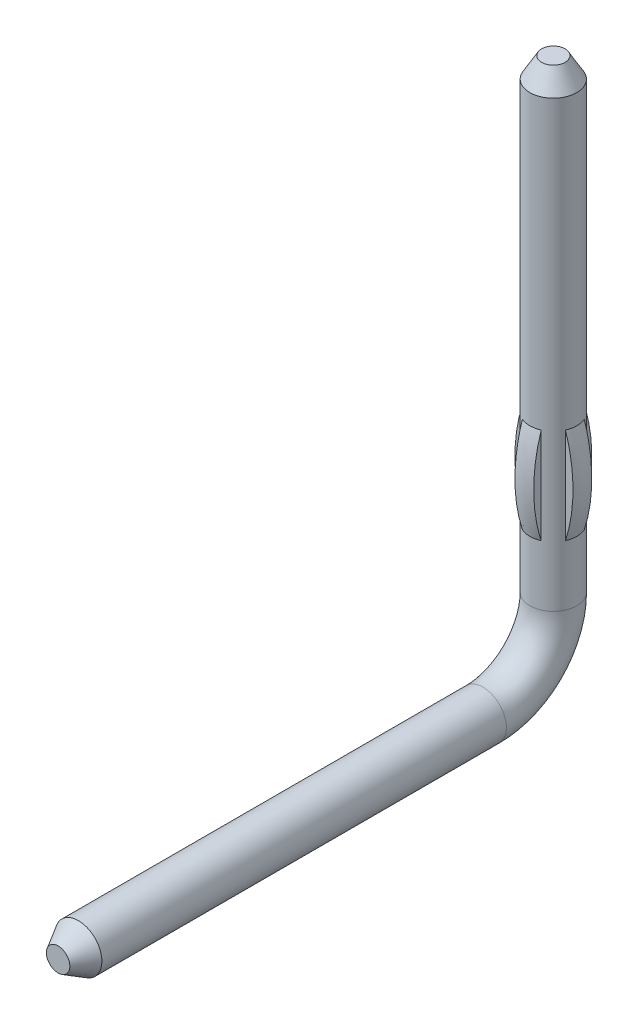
ISO-10303-21;
HEADER;
FILE_DESCRIPTION(('STEP AP214'),'2;1');
FILE_NAME('part.step','',(''),(''),'','','');
FILE_SCHEMA(('AUTOMOTIVE_DESIGN { 1 0 10303 214 1 1 1 1 }'));
ENDSEC;
DATA;
#1=APPLICATION_CONTEXT('core data for automotive mechanical design processes');
#2=APPLICATION_PROTOCOL_DEFINITION('international standard','automotive_design',2000,#1);
#3=PRODUCT_CONTEXT('',#1,'mechanical');
#4=PRODUCT('Part','Part','',(#3));
#5=PRODUCT_RELATED_PRODUCT_CATEGORY('part','',(#4));
#6=PRODUCT_DEFINITION_FORMATION('','',#4);
#7=PRODUCT_DEFINITION_CONTEXT('part definition',#1,'design');
#8=PRODUCT_DEFINITION('design','',#6,#7);
#9=PRODUCT_DEFINITION_SHAPE('','',#8);
#10=(LENGTH_UNIT() NAMED_UNIT(*) SI_UNIT(.MILLI.,.METRE.));
#11=(NAMED_UNIT(*) PLANE_ANGLE_UNIT() SI_UNIT($,.RADIAN.));
#12=(NAMED_UNIT(*) SI_UNIT($,.STERADIAN.) SOLID_ANGLE_UNIT());
#13=UNCERTAINTY_MEASURE_WITH_UNIT(LENGTH_MEASURE(1.E-05),#10,'distance_accuracy_value','');
#14=(GEOMETRIC_REPRESENTATION_CONTEXT(3) GLOBAL_UNCERTAINTY_ASSIGNED_CONTEXT((#13)) GLOBAL_UNIT_ASSIGNED_CONTEXT((#10,
#11,#12)) REPRESENTATION_CONTEXT('',''));
#15=CARTESIAN_POINT('',(0.,0.,0.));
#16=DIRECTION('',(0.,0.,1.));
#17=DIRECTION('',(1.,0.,0.));
#18=AXIS2_PLACEMENT_3D('',#15,#16,#17);
#19=CARTESIAN_POINT('',(-2.135349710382,-0.6651640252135,5.275));
#20=DIRECTION('',(0.,0.,1.));
#21=DIRECTION('',(0.,-1.,0.));
#22=AXIS2_PLACEMENT_3D('',#19,#20,#21);
#23=PLANE('',#22);
#24=CARTESIAN_POINT('',(-2.,-0.8,5.27499999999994));
#25=DIRECTION('',(0.,0.,-1.));
#26=DIRECTION('',(-1.,0.,0.));
#27=AXIS2_PLACEMENT_3D('',#24,#25,#26);
#28=CIRCLE('',#27,0.125000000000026);
#29=CARTESIAN_POINT('',(-2.12500000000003,-0.8,5.27499999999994));
#30=VERTEX_POINT('',#29);
#31=EDGE_CURVE('E21',#30,#30,#28,.F.);
#32=ORIENTED_EDGE('',*,*,#31,.T.);
#33=EDGE_LOOP('',(#32));
#34=FACE_BOUND('',#33,.T.);
#35=ADVANCED_FACE('F17',(#34),#23,.T.);
#36=CARTESIAN_POINT('',(-2.,-0.8,5.05849364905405));
#37=DIRECTION('',(0.,0.,-1.));
#38=DIRECTION('',(-1.,0.,0.));
#39=AXIS2_PLACEMENT_3D('',#36,#37,#38);
#40=CONICAL_SURFACE('',#39,0.249999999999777,0.523598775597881);
#41=CARTESIAN_POINT('',(-2.,-0.8,5.05849364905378));
#42=DIRECTION('',(0.,0.,1.));
#43=DIRECTION('',(0.,-1.,0.));
#44=AXIS2_PLACEMENT_3D('',#41,#42,#43);
#45=CIRCLE('',#44,0.25);
#46=CARTESIAN_POINT('',(-2.,-1.05,5.05849364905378));
#47=VERTEX_POINT('',#46);
#48=EDGE_CURVE('E88',#47,#47,#45,.T.);
#49=ORIENTED_EDGE('',*,*,#48,.T.);
#50=EDGE_LOOP('',(#49));
#51=FACE_BOUND('',#50,.T.);
#52=ORIENTED_EDGE('',*,*,#31,.F.);
#53=EDGE_LOOP('',(#52));
#54=FACE_BOUND('',#53,.T.);
#55=ADVANCED_FACE('F173',(#51,#54),#40,.T.);
#56=CARTESIAN_POINT('',(-2.,-0.8,0.749999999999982));
#57=DIRECTION('',(0.,0.,1.));
#58=DIRECTION('',(1.,0.,0.));
#59=AXIS2_PLACEMENT_3D('',#56,#57,#58);
#60=CYLINDRICAL_SURFACE('',#59,0.25);
#61=ORIENTED_EDGE('',*,*,#48,.F.);
#62=EDGE_LOOP('',(#61));
#63=FACE_BOUND('',#62,.T.);
#64=CARTESIAN_POINT('',(-2.,-0.8,0.749999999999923));
#65=DIRECTION('',(0.,1.03212393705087E-13,-1.));
#66=DIRECTION('',(0.0627905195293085,-0.998026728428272,-1.03008727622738E-13));
#67=AXIS2_PLACEMENT_3D('',#64,#65,#66);
#68=CIRCLE('',#67,0.25);
#69=CARTESIAN_POINT('',(-1.98430237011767,-1.04950668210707,0.749999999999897));
#70=VERTEX_POINT('',#69);
#71=EDGE_CURVE('E160',#70,#70,#68,.F.);
#72=ORIENTED_EDGE('',*,*,#71,.T.);
#73=EDGE_LOOP('',(#72));
#74=FACE_BOUND('',#73,.T.);
#75=ADVANCED_FACE('F118',(#63,#74),#60,.T.);
#76=CARTESIAN_POINT('',(-1.9,0.5696,0.3190688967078));
#77=DIRECTION('',(1.,0.,0.));
#78=DIRECTION('',(0.,0.,-1.));
#79=AXIS2_PLACEMENT_3D('',#76,#77,#78);
#80=PLANE('',#79);
#81=CARTESIAN_POINT('',(-1.9,1.61000000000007,0.22912878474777));
#82=CARTESIAN_POINT('',(-1.9,1.57873023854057,0.239375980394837));
#83=CARTESIAN_POINT('',(-1.9,1.54713852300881,0.248610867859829));
#84=CARTESIAN_POINT('',(-1.9,1.48345199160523,0.265095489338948));
#85=CARTESIAN_POINT('',(-1.9,1.45135734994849,0.272345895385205));
#86=CARTESIAN_POINT('',(-1.9,1.35425691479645,0.291235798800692));
#87=CARTESIAN_POINT('',(-1.9,1.28866987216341,0.299938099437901));
#88=CARTESIAN_POINT('',(-1.9,1.12854165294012,0.31163857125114));
#89=CARTESIAN_POINT('',(-1.9,1.03366604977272,0.310580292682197));
#90=CARTESIAN_POINT('',(-1.9,0.89273024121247,0.297089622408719));
#91=CARTESIAN_POINT('',(-1.9,0.846013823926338,0.290617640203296));
#92=CARTESIAN_POINT('',(-1.9,0.753312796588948,0.273699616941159));
#93=CARTESIAN_POINT('',(-1.9,0.707327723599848,0.263256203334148));
#94=CARTESIAN_POINT('',(-1.9,0.637769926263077,0.244137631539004));
#95=CARTESIAN_POINT('',(-1.9,0.613787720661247,0.236925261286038));
#96=CARTESIAN_POINT('',(-1.9,0.589999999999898,0.229128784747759));
#97=B_SPLINE_CURVE_WITH_KNOTS('',3,(#81,#82,#83,#84,#85,#86,#87,#88,#89,#90,#91,#92,#93,#94,#95,
#96),.UNSPECIFIED.,.F.,.F.,(4,2,2,2,2,2,2,4),(0.,0.0986850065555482,0.197336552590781,
0.395376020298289,0.678491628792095,0.819849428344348,0.961113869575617,1.03621412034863),.UNSPECIFIED.);
#98=CARTESIAN_POINT('',(-1.89999999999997,1.61000000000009,0.229128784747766));
#99=VERTEX_POINT('',#98);
#100=CARTESIAN_POINT('',(-1.89999999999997,0.589999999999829,0.22912878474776));
#101=VERTEX_POINT('',#100);
#102=EDGE_CURVE('E154',#99,#101,#97,.T.);
#103=ORIENTED_EDGE('',*,*,#102,.T.);
#104=DIRECTION('',(0.,1.,0.));
#105=VECTOR('',#104,1.);
#106=CARTESIAN_POINT('',(-1.89999999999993,2.31674682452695,0.229128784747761));
#107=LINE('',#106,#105);
#108=EDGE_CURVE('E101',#101,#99,#107,.T.);
#109=ORIENTED_EDGE('',*,*,#108,.T.);
#110=EDGE_LOOP('',(#103,#109));
#111=FACE_BOUND('',#110,.T.);
#112=ADVANCED_FACE('F167',(#111),#80,.T.);
#113=CARTESIAN_POINT('',(-1.9,0.5696,-0.3190688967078));
#114=DIRECTION('',(-1.,0.,0.));
#115=DIRECTION('',(0.,0.,1.));
#116=AXIS2_PLACEMENT_3D('',#113,#114,#115);
#117=PLANE('',#116);
#118=CARTESIAN_POINT('',(-1.9,0.5899999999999,-0.229128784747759));
#119=CARTESIAN_POINT('',(-1.9,0.621269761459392,-0.239375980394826));
#120=CARTESIAN_POINT('',(-1.9,0.652861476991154,-0.248610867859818));
#121=CARTESIAN_POINT('',(-1.9,0.716548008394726,-0.265095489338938));
#122=CARTESIAN_POINT('',(-1.9,0.748642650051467,-0.272345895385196));
#123=CARTESIAN_POINT('',(-1.9,0.845743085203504,-0.291235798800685));
#124=CARTESIAN_POINT('',(-1.9,0.911330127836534,-0.299938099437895));
#125=CARTESIAN_POINT('',(-1.9,1.07145834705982,-0.311638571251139));
#126=CARTESIAN_POINT('',(-1.9,1.16633395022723,-0.3105802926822));
#127=CARTESIAN_POINT('',(-1.9,1.30726975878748,-0.297089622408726));
#128=CARTESIAN_POINT('',(-1.9,1.35398617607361,-0.290617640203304));
#129=CARTESIAN_POINT('',(-1.9,1.446687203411,-0.27369961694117));
#130=CARTESIAN_POINT('',(-1.9,1.4926722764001,-0.263256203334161));
#131=CARTESIAN_POINT('',(-1.9,1.56223007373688,-0.244137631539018));
#132=CARTESIAN_POINT('',(-1.9,1.58621227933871,-0.236925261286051));
#133=CARTESIAN_POINT('',(-1.9,1.61000000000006,-0.229128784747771));
#134=B_SPLINE_CURVE_WITH_KNOTS('',3,(#118,#119,#120,#121,#122,#123,#124,#125,#126,#127,#128,
#129,#130,#131,#132,#133),.UNSPECIFIED.,.F.,.F.,(4,2,2,2,2,2,2,4),(0.,0.0986850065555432,
0.197336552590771,0.39537602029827,0.678491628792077,0.81984942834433,0.961113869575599,
1.03621412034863),.UNSPECIFIED.);
#135=CARTESIAN_POINT('',(-1.9,0.58999999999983,-0.229128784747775));
#136=VERTEX_POINT('',#135);
#137=CARTESIAN_POINT('',(-1.9,1.61000000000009,-0.229128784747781));
#138=VERTEX_POINT('',#137);
#139=EDGE_CURVE('E278',#136,#138,#134,.T.);
#140=ORIENTED_EDGE('',*,*,#139,.T.);
#141=DIRECTION('',(0.,-1.,0.));
#142=VECTOR('',#141,1.);
#143=CARTESIAN_POINT('',(-1.9,2.31674682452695,-0.229128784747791));
#144=LINE('',#143,#142);
#145=EDGE_CURVE('E98',#138,#136,#144,.T.);
#146=ORIENTED_EDGE('',*,*,#145,.T.);
#147=EDGE_LOOP('',(#140,#146));
#148=FACE_BOUND('',#147,.T.);
#149=ADVANCED_FACE('F134',(#148),#117,.F.);
#150=CARTESIAN_POINT('',(-1.780707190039,0.5696,0.1));
#151=DIRECTION('',(0.,0.,1.));
#152=DIRECTION('',(1.,0.,0.));
#153=AXIS2_PLACEMENT_3D('',#150,#151,#152);
#154=PLANE('',#153);
#155=CARTESIAN_POINT('',(-1.77087121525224,0.589999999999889,0.1));
#156=CARTESIAN_POINT('',(-1.76062401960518,0.621269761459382,0.1));
#157=CARTESIAN_POINT('',(-1.75138913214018,0.652861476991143,0.1));
#158=CARTESIAN_POINT('',(-1.73490451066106,0.716548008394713,0.1));
#159=CARTESIAN_POINT('',(-1.72765410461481,0.748642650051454,0.1));
#160=CARTESIAN_POINT('',(-1.70876420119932,0.845743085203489,0.0999999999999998));
#161=CARTESIAN_POINT('',(-1.70006190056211,0.911330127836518,0.0999999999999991));
#162=CARTESIAN_POINT('',(-1.68836142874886,1.0714583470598,0.0999999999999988));
#163=CARTESIAN_POINT('',(-1.6894197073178,1.16633395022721,0.0999999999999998));
#164=CARTESIAN_POINT('',(-1.70291037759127,1.30726975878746,0.1));
#165=CARTESIAN_POINT('',(-1.70938235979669,1.35398617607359,0.1));
#166=CARTESIAN_POINT('',(-1.72630038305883,1.44668720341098,0.1));
#167=CARTESIAN_POINT('',(-1.73674379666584,1.49267227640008,0.1));
#168=CARTESIAN_POINT('',(-1.75586236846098,1.56223007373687,0.1));
#169=CARTESIAN_POINT('',(-1.76307473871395,1.58621227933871,0.1));
#170=CARTESIAN_POINT('',(-1.77087121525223,1.61000000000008,0.1));
#171=B_SPLINE_CURVE_WITH_KNOTS('',3,(#155,#156,#157,#158,#159,#160,#161,#162,#163,#164,#165,
#166,#167,#168,#169,#170),.UNSPECIFIED.,.F.,.F.,(4,2,2,2,2,2,2,4),(0.,0.0986850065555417,
0.197336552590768,0.395376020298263,0.67849162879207,0.819849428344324,0.961113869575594,
1.03621412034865),.UNSPECIFIED.);
#172=CARTESIAN_POINT('',(-1.77087121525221,0.589999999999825,0.099999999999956));
#173=VERTEX_POINT('',#172);
#174=CARTESIAN_POINT('',(-1.7708712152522,1.61000000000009,0.0999999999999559));
#175=VERTEX_POINT('',#174);
#176=EDGE_CURVE('E80',#173,#175,#171,.T.);
#177=ORIENTED_EDGE('',*,*,#176,.T.);
#178=DIRECTION('',(0.,-1.,0.));
#179=VECTOR('',#178,1.);
#180=CARTESIAN_POINT('',(-1.77087121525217,2.31674682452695,0.0999999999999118));
#181=LINE('',#180,#179);
#182=EDGE_CURVE('E86',#175,#173,#181,.T.);
#183=ORIENTED_EDGE('',*,*,#182,.T.);
#184=EDGE_LOOP('',(#177,#183));
#185=FACE_BOUND('',#184,.T.);
#186=ADVANCED_FACE('F85',(#185),#154,.T.);
#187=CARTESIAN_POINT('',(-2.,1.1,-1.4465));
#188=DIRECTION('',(1.,0.,0.));
#189=DIRECTION('',(0.,0.299058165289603,0.95423488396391));
#190=AXIS2_PLACEMENT_3D('',#187,#188,#189);
#191=CIRCLE('',#190,1.7715);
#192=TRIMMED_CURVE('',#191,(PARAMETER_VALUE(-0.31169960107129)),
(PARAMETER_VALUE(0.919110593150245)),.T.,.PARAMETER.);
#193=CARTESIAN_POINT('',(-2.,1.1,0.));
#194=DIRECTION('',(0.,-1.,0.));
#195=AXIS1_PLACEMENT('',#193,#194);
#196=SURFACE_OF_REVOLUTION('',#192,#195);
#197=CARTESIAN_POINT('',(-1.77087121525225,0.589999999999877,-0.1));
#198=CARTESIAN_POINT('',(-1.76062401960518,0.621269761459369,-0.1));
#199=CARTESIAN_POINT('',(-1.75138913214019,0.652861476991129,-0.1));
#200=CARTESIAN_POINT('',(-1.73490451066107,0.716548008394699,-0.1));
#201=CARTESIAN_POINT('',(-1.72765410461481,0.748642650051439,-0.1));
#202=CARTESIAN_POINT('',(-1.70876420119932,0.845743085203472,-0.0999999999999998));
#203=CARTESIAN_POINT('',(-1.70006190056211,0.911330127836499,-0.0999999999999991));
#204=CARTESIAN_POINT('',(-1.68836142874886,1.07145834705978,-0.0999999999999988));
#205=CARTESIAN_POINT('',(-1.6894197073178,1.16633395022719,-0.0999999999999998));
#206=CARTESIAN_POINT('',(-1.70291037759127,1.30726975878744,-0.1));
#207=CARTESIAN_POINT('',(-1.70938235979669,1.35398617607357,-0.1));
#208=CARTESIAN_POINT('',(-1.72630038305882,1.44668720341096,-0.1));
#209=CARTESIAN_POINT('',(-1.73674379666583,1.49267227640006,-0.1));
#210=CARTESIAN_POINT('',(-1.75586236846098,1.56223007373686,-0.1));
#211=CARTESIAN_POINT('',(-1.76307473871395,1.58621227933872,-0.1));
#212=CARTESIAN_POINT('',(-1.77087121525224,1.61000000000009,-0.1));
#213=B_SPLINE_CURVE_WITH_KNOTS('',3,(#197,#198,#199,#200,#201,#202,#203,#204,#205,#206,#207,
#208,#209,#210,#211,#212),.UNSPECIFIED.,.F.,.F.,(4,2,2,2,2,2,2,4),(0.,0.0986850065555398,
0.197336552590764,0.395376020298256,0.678491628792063,0.819849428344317,0.961113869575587,
1.03621412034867),.UNSPECIFIED.);
#214=CARTESIAN_POINT('',(-1.77087121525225,0.589999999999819,-0.100000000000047));
#215=VERTEX_POINT('',#214);
#216=CARTESIAN_POINT('',(-1.77087121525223,1.61000000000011,-0.100000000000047));
#217=VERTEX_POINT('',#216);
#218=EDGE_CURVE('E87',#215,#217,#213,.T.);
#219=ORIENTED_EDGE('',*,*,#218,.T.);
#220=CARTESIAN_POINT('',(-2.,1.61000000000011,0.));
#221=DIRECTION('',(0.,-1.,0.));
#222=DIRECTION('',(0.,0.,-1.));
#223=AXIS2_PLACEMENT_3D('',#220,#221,#222);
#224=CIRCLE('',#223,0.25);
#225=EDGE_CURVE('E92',#217,#175,#224,.T.);
#226=ORIENTED_EDGE('',*,*,#225,.T.);
#227=ORIENTED_EDGE('',*,*,#176,.F.);
#228=CARTESIAN_POINT('',(-2.,0.58999999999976,0.));
#229=DIRECTION('',(0.,-1.,0.));
#230=DIRECTION('',(0.,0.,-1.));
#231=AXIS2_PLACEMENT_3D('',#228,#229,#230);
#232=CIRCLE('',#231,0.25);
#233=EDGE_CURVE('E94',#173,#215,#232,.F.);
#234=ORIENTED_EDGE('',*,*,#233,.T.);
#235=EDGE_LOOP('',(#219,#226,#227,#234));
#236=FACE_BOUND('',#235,.T.);
#237=ADVANCED_FACE('F96',(#236),#196,.T.);
#238=CARTESIAN_POINT('',(-1.780707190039,0.5696,-0.1));
#239=DIRECTION('',(0.,0.,1.));
#240=DIRECTION('',(1.,0.,0.));
#241=AXIS2_PLACEMENT_3D('',#238,#239,#240);
#242=PLANE('',#241);
#243=ORIENTED_EDGE('',*,*,#218,.F.);
#244=DIRECTION('',(0.,1.,0.));
#245=VECTOR('',#244,1.);
#246=CARTESIAN_POINT('',(-1.77087121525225,2.31674682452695,-0.100000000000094));
#247=LINE('',#246,#245);
#248=EDGE_CURVE('E105',#215,#217,#247,.T.);
#249=ORIENTED_EDGE('',*,*,#248,.T.);
#250=EDGE_LOOP('',(#243,#249));
#251=FACE_BOUND('',#250,.T.);
#252=ADVANCED_FACE('F113',(#251),#242,.F.);
#253=CARTESIAN_POINT('',(-2.1,0.5696,0.3190688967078));
#254=DIRECTION('',(1.,0.,0.));
#255=DIRECTION('',(0.,0.,-1.));
#256=AXIS2_PLACEMENT_3D('',#253,#254,#255);
#257=PLANE('',#256);
#258=CARTESIAN_POINT('',(-2.1,0.589999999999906,0.229128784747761));
#259=CARTESIAN_POINT('',(-2.1,0.621269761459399,0.239375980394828));
#260=CARTESIAN_POINT('',(-2.1,0.652861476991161,0.24861086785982));
#261=CARTESIAN_POINT('',(-2.1,0.716548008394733,0.26509548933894));
#262=CARTESIAN_POINT('',(-2.1,0.748642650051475,0.272345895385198));
#263=CARTESIAN_POINT('',(-2.1,0.845743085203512,0.291235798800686));
#264=CARTESIAN_POINT('',(-2.1,0.911330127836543,0.299938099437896));
#265=CARTESIAN_POINT('',(-2.1,1.07145834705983,0.311638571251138));
#266=CARTESIAN_POINT('',(-2.1,1.16633395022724,0.310580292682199));
#267=CARTESIAN_POINT('',(-2.1,1.30726975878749,0.297089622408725));
#268=CARTESIAN_POINT('',(-2.1,1.35398617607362,0.290617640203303));
#269=CARTESIAN_POINT('',(-2.1,1.44668720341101,0.273699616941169));
#270=CARTESIAN_POINT('',(-2.1,1.49267227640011,0.263256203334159));
#271=CARTESIAN_POINT('',(-2.1,1.56223007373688,0.244137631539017));
#272=CARTESIAN_POINT('',(-2.1,1.58621227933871,0.236925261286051));
#273=CARTESIAN_POINT('',(-2.1,1.61000000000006,0.229128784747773));
#274=B_SPLINE_CURVE_WITH_KNOTS('',3,(#258,#259,#260,#261,#262,#263,#264,#265,#266,#267,#268,
#269,#270,#271,#272,#273),.UNSPECIFIED.,.F.,.F.,(4,2,2,2,2,2,2,4),(0.,0.0986850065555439,
0.197336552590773,0.395376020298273,0.678491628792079,0.819849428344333,0.961113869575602,
1.03621412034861),.UNSPECIFIED.);
#275=CARTESIAN_POINT('',(-2.09999999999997,0.589999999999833,0.229128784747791));
#276=VERTEX_POINT('',#275);
#277=CARTESIAN_POINT('',(-2.09999999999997,1.61000000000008,0.229128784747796));
#278=VERTEX_POINT('',#277);
#279=EDGE_CURVE('E149',#276,#278,#274,.T.);
#280=ORIENTED_EDGE('',*,*,#279,.T.);
#281=DIRECTION('',(0.,-1.,0.));
#282=VECTOR('',#281,1.);
#283=CARTESIAN_POINT('',(-2.09999999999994,2.31674682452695,0.22912878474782));
#284=LINE('',#283,#282);
#285=EDGE_CURVE('E225',#278,#276,#284,.T.);
#286=ORIENTED_EDGE('',*,*,#285,.T.);
#287=EDGE_LOOP('',(#280,#286));
#288=FACE_BOUND('',#287,.T.);
#289=ADVANCED_FACE('F140',(#288),#257,.F.);
#290=CARTESIAN_POINT('',(-2.,1.1,-1.4465));
#291=DIRECTION('',(1.,0.,0.));
#292=DIRECTION('',(0.,0.299058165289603,0.95423488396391));
#293=AXIS2_PLACEMENT_3D('',#290,#291,#292);
#294=CIRCLE('',#293,1.7715);
#295=TRIMMED_CURVE('',#294,(PARAMETER_VALUE(-0.31169960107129)),
(PARAMETER_VALUE(0.919110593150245)),.T.,.PARAMETER.);
#296=CARTESIAN_POINT('',(-2.,1.1,0.));
#297=DIRECTION('',(0.,-1.,0.));
#298=AXIS1_PLACEMENT('',#296,#297);
#299=SURFACE_OF_REVOLUTION('',#295,#298);
#300=CARTESIAN_POINT('',(-2.,0.58999999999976,0.));
#301=DIRECTION('',(0.,-1.,0.));
#302=DIRECTION('',(0.,0.,-1.));
#303=AXIS2_PLACEMENT_3D('',#300,#301,#302);
#304=CIRCLE('',#303,0.25);
#305=EDGE_CURVE('E244',#276,#101,#304,.F.);
#306=ORIENTED_EDGE('',*,*,#305,.T.);
#307=ORIENTED_EDGE('',*,*,#102,.F.);
#308=CARTESIAN_POINT('',(-2.,1.61000000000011,0.));
#309=DIRECTION('',(0.,-1.,0.));
#310=DIRECTION('',(0.,0.,-1.));
#311=AXIS2_PLACEMENT_3D('',#308,#309,#310);
#312=CIRCLE('',#311,0.25);
#313=EDGE_CURVE('E222',#99,#278,#312,.T.);
#314=ORIENTED_EDGE('',*,*,#313,.T.);
#315=ORIENTED_EDGE('',*,*,#279,.F.);
#316=EDGE_LOOP('',(#306,#307,#314,#315));
#317=FACE_BOUND('',#316,.T.);
#318=ADVANCED_FACE('F114',(#317),#299,.T.);
#319=CARTESIAN_POINT('',(-2.,-0.05,0.75));
#320=DIRECTION('',(-1.,0.,0.));
#321=DIRECTION('',(0.,0.,1.));
#322=AXIS2_PLACEMENT_3D('',#319,#320,#321);
#323=TOROIDAL_SURFACE('',#322,0.75,0.25);
#324=ORIENTED_EDGE('',*,*,#71,.F.);
#325=EDGE_LOOP('',(#324));
#326=FACE_BOUND('',#325,.T.);
#327=CARTESIAN_POINT('',(-2.,-0.0499999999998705,0.));
#328=DIRECTION('',(0.,-1.,0.));
#329=DIRECTION('',(0.,0.,-1.));
#330=AXIS2_PLACEMENT_3D('',#327,#328,#329);
#331=CIRCLE('',#330,0.25);
#332=CARTESIAN_POINT('',(-2.,-0.0499999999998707,-0.25));
#333=VERTEX_POINT('',#332);
#334=EDGE_CURVE('E239',#333,#333,#331,.T.);
#335=ORIENTED_EDGE('',*,*,#334,.T.);
#336=EDGE_LOOP('',(#335));
#337=FACE_BOUND('',#336,.T.);
#338=ADVANCED_FACE('F248',(#326,#337),#323,.T.);
#339=CARTESIAN_POINT('',(-2.1,0.5696,-0.3190688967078));
#340=DIRECTION('',(-1.,0.,0.));
#341=DIRECTION('',(0.,0.,1.));
#342=AXIS2_PLACEMENT_3D('',#339,#340,#341);
#343=PLANE('',#342);
#344=CARTESIAN_POINT('',(-2.1,1.61000000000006,-0.229128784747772));
#345=CARTESIAN_POINT('',(-2.1,1.57873023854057,-0.239375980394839));
#346=CARTESIAN_POINT('',(-2.1,1.5471385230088,-0.248610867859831));
#347=CARTESIAN_POINT('',(-2.1,1.48345199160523,-0.265095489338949));
#348=CARTESIAN_POINT('',(-2.1,1.45135734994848,-0.272345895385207));
#349=CARTESIAN_POINT('',(-2.1,1.35425691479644,-0.291235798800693));
#350=CARTESIAN_POINT('',(-2.1,1.28866987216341,-0.299938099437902));
#351=CARTESIAN_POINT('',(-2.1,1.12854165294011,-0.31163857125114));
#352=CARTESIAN_POINT('',(-2.1,1.03366604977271,-0.310580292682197));
#353=CARTESIAN_POINT('',(-2.1,0.892730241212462,-0.297089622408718));
#354=CARTESIAN_POINT('',(-2.1,0.84601382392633,-0.290617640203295));
#355=CARTESIAN_POINT('',(-2.1,0.753312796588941,-0.273699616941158));
#356=CARTESIAN_POINT('',(-2.1,0.707327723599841,-0.263256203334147));
#357=CARTESIAN_POINT('',(-2.1,0.637769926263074,-0.244137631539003));
#358=CARTESIAN_POINT('',(-2.1,0.613787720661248,-0.236925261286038));
#359=CARTESIAN_POINT('',(-2.1,0.589999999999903,-0.22912878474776));
#360=B_SPLINE_CURVE_WITH_KNOTS('',3,(#344,#345,#346,#347,#348,#349,#350,#351,#352,#353,#354,
#355,#356,#357,#358,#359),.UNSPECIFIED.,.F.,.F.,(4,2,2,2,2,2,2,4),(0.,0.0986850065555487,
0.197336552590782,0.395376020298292,0.678491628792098,0.819849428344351,0.96111386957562,
1.03621412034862),.UNSPECIFIED.);
#361=CARTESIAN_POINT('',(-2.10000000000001,1.61000000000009,-0.229128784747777));
#362=VERTEX_POINT('',#361);
#363=CARTESIAN_POINT('',(-2.10000000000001,0.589999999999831,-0.229128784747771));
#364=VERTEX_POINT('',#363);
#365=EDGE_CURVE('E161',#362,#364,#360,.T.);
#366=ORIENTED_EDGE('',*,*,#365,.T.);
#367=DIRECTION('',(0.,1.,0.));
#368=VECTOR('',#367,1.);
#369=CARTESIAN_POINT('',(-2.10000000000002,2.31674682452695,-0.229128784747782));
#370=LINE('',#369,#368);
#371=EDGE_CURVE('E230',#364,#362,#370,.T.);
#372=ORIENTED_EDGE('',*,*,#371,.T.);
#373=EDGE_LOOP('',(#366,#372));
#374=FACE_BOUND('',#373,.T.);
#375=ADVANCED_FACE('F146',(#374),#343,.T.);
#376=CARTESIAN_POINT('',(-2.,1.1,-1.4465));
#377=DIRECTION('',(1.,0.,0.));
#378=DIRECTION('',(0.,0.299058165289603,0.95423488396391));
#379=AXIS2_PLACEMENT_3D('',#376,#377,#378);
#380=CIRCLE('',#379,1.7715);
#381=TRIMMED_CURVE('',#380,(PARAMETER_VALUE(-0.31169960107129)),
(PARAMETER_VALUE(0.919110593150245)),.T.,.PARAMETER.);
#382=CARTESIAN_POINT('',(-2.,1.1,0.));
#383=DIRECTION('',(0.,-1.,0.));
#384=AXIS1_PLACEMENT('',#382,#383);
#385=SURFACE_OF_REVOLUTION('',#381,#384);
#386=CARTESIAN_POINT('',(-2.,1.61000000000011,0.));
#387=DIRECTION('',(0.,-1.,0.));
#388=DIRECTION('',(0.,0.,-1.));
#389=AXIS2_PLACEMENT_3D('',#386,#387,#388);
#390=CIRCLE('',#389,0.25);
#391=EDGE_CURVE('E228',#362,#138,#390,.T.);
#392=ORIENTED_EDGE('',*,*,#391,.T.);
#393=ORIENTED_EDGE('',*,*,#139,.F.);
#394=CARTESIAN_POINT('',(-2.,0.58999999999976,0.));
#395=DIRECTION('',(0.,-1.,0.));
#396=DIRECTION('',(0.,0.,-1.));
#397=AXIS2_PLACEMENT_3D('',#394,#395,#396);
#398=CIRCLE('',#397,0.25);
#399=EDGE_CURVE('E236',#136,#364,#398,.F.);
#400=ORIENTED_EDGE('',*,*,#399,.T.);
#401=ORIENTED_EDGE('',*,*,#365,.F.);
#402=EDGE_LOOP('',(#392,#393,#400,#401));
#403=FACE_BOUND('',#402,.T.);
#404=ADVANCED_FACE('F208',(#403),#385,.T.);
#405=CARTESIAN_POINT('',(-2.219292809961,0.5696,0.1));
#406=DIRECTION('',(0.,0.,-1.));
#407=DIRECTION('',(-1.,0.,0.));
#408=AXIS2_PLACEMENT_3D('',#405,#406,#407);
#409=PLANE('',#408);
#410=CARTESIAN_POINT('',(-2.22912878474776,1.61000000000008,0.1));
#411=CARTESIAN_POINT('',(-2.23937598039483,1.57873023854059,0.0999999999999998));
#412=CARTESIAN_POINT('',(-2.24861086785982,1.54713852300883,0.0999999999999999));
#413=CARTESIAN_POINT('',(-2.26509548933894,1.48345199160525,0.1));
#414=CARTESIAN_POINT('',(-2.2723458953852,1.45135734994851,0.1));
#415=CARTESIAN_POINT('',(-2.29123579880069,1.35425691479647,0.0999999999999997));
#416=CARTESIAN_POINT('',(-2.2999380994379,1.28866987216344,0.0999999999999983));
#417=CARTESIAN_POINT('',(-2.31163857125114,1.12854165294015,0.0999999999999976));
#418=CARTESIAN_POINT('',(-2.3105802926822,1.03366604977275,0.0999999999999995));
#419=CARTESIAN_POINT('',(-2.29708962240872,0.892730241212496,0.1));
#420=CARTESIAN_POINT('',(-2.2906176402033,0.846013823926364,0.1));
#421=CARTESIAN_POINT('',(-2.27369961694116,0.753312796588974,0.0999999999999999));
#422=CARTESIAN_POINT('',(-2.26325620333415,0.707327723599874,0.0999999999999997));
#423=CARTESIAN_POINT('',(-2.24413763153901,0.637769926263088,0.0999999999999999));
#424=CARTESIAN_POINT('',(-2.23692526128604,0.613787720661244,0.1));
#425=CARTESIAN_POINT('',(-2.22912878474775,0.589999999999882,0.1));
#426=B_SPLINE_CURVE_WITH_KNOTS('',3,(#410,#411,#412,#413,#414,#415,#416,#417,#418,#419,#420,
#421,#422,#423,#424,#425),.UNSPECIFIED.,.F.,.F.,(4,2,2,2,2,2,2,4),(0.,0.0986850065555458,
0.197336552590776,0.39537602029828,0.678491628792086,0.819849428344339,0.961113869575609,
1.03621412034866),.UNSPECIFIED.);
#427=CARTESIAN_POINT('',(-2.22912878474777,1.6100000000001,0.100000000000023));
#428=VERTEX_POINT('',#427);
#429=CARTESIAN_POINT('',(-2.22912878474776,0.589999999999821,0.100000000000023));
#430=VERTEX_POINT('',#429);
#431=EDGE_CURVE('E287',#428,#430,#426,.T.);
#432=ORIENTED_EDGE('',*,*,#431,.T.);
#433=DIRECTION('',(0.,1.,0.));
#434=VECTOR('',#433,1.);
#435=CARTESIAN_POINT('',(-2.22912878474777,2.31674682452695,0.100000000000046));
#436=LINE('',#435,#434);
#437=EDGE_CURVE('E218',#430,#428,#436,.T.);
#438=ORIENTED_EDGE('',*,*,#437,.T.);
#439=EDGE_LOOP('',(#432,#438));
#440=FACE_BOUND('',#439,.T.);
#441=ADVANCED_FACE('F206',(#440),#409,.F.);
#442=CARTESIAN_POINT('',(-2.,1.1,-1.4465));
#443=DIRECTION('',(1.,0.,0.));
#444=DIRECTION('',(0.,0.299058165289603,0.95423488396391));
#445=AXIS2_PLACEMENT_3D('',#442,#443,#444);
#446=CIRCLE('',#445,1.7715);
#447=TRIMMED_CURVE('',#446,(PARAMETER_VALUE(-0.31169960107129)),
(PARAMETER_VALUE(0.919110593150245)),.T.,.PARAMETER.);
#448=CARTESIAN_POINT('',(-2.,1.1,0.));
#449=DIRECTION('',(0.,-1.,0.));
#450=AXIS1_PLACEMENT('',#448,#449);
#451=SURFACE_OF_REVOLUTION('',#447,#450);
#452=CARTESIAN_POINT('',(-2.22912878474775,0.589999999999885,-0.1));
#453=CARTESIAN_POINT('',(-2.23937598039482,0.621269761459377,-0.0999999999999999));
#454=CARTESIAN_POINT('',(-2.24861086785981,0.652861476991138,-0.1));
#455=CARTESIAN_POINT('',(-2.26509548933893,0.716548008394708,-0.1));
#456=CARTESIAN_POINT('',(-2.27234589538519,0.748642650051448,-0.1));
#457=CARTESIAN_POINT('',(-2.29123579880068,0.845743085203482,-0.0999999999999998));
#458=CARTESIAN_POINT('',(-2.29993809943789,0.911330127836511,-0.0999999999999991));
#459=CARTESIAN_POINT('',(-2.31163857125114,1.0714583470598,-0.0999999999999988));
#460=CARTESIAN_POINT('',(-2.3105802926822,1.1663339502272,-0.0999999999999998));
#461=CARTESIAN_POINT('',(-2.29708962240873,1.30726975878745,-0.1));
#462=CARTESIAN_POINT('',(-2.29061764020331,1.35398617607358,-0.1));
#463=CARTESIAN_POINT('',(-2.27369961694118,1.44668720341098,-0.1));
#464=CARTESIAN_POINT('',(-2.26325620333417,1.49267227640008,-0.1));
#465=CARTESIAN_POINT('',(-2.24413763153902,1.56223007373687,-0.1));
#466=CARTESIAN_POINT('',(-2.23692526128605,1.58621227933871,-0.1));
#467=CARTESIAN_POINT('',(-2.22912878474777,1.61000000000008,-0.1));
#468=B_SPLINE_CURVE_WITH_KNOTS('',3,(#452,#453,#454,#455,#456,#457,#458,#459,#460,#461,#462,
#463,#464,#465,#466,#467),.UNSPECIFIED.,.F.,.F.,(4,2,2,2,2,2,2,4),(0.,0.0986850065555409,
0.197336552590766,0.39537602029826,0.678491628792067,0.819849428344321,0.961113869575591,
1.03621412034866),.UNSPECIFIED.);
#469=CARTESIAN_POINT('',(-2.22912878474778,0.589999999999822,-0.0999999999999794));
#470=VERTEX_POINT('',#469);
#471=CARTESIAN_POINT('',(-2.22912878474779,1.61000000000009,-0.0999999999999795));
#472=VERTEX_POINT('',#471);
#473=EDGE_CURVE('E35',#470,#472,#468,.T.);
#474=ORIENTED_EDGE('',*,*,#473,.F.);
#475=CARTESIAN_POINT('',(-2.,0.58999999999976,0.));
#476=DIRECTION('',(0.,-1.,0.));
#477=DIRECTION('',(0.,0.,-1.));
#478=AXIS2_PLACEMENT_3D('',#475,#476,#477);
#479=CIRCLE('',#478,0.25);
#480=EDGE_CURVE('E216',#470,#430,#479,.F.);
#481=ORIENTED_EDGE('',*,*,#480,.T.);
#482=ORIENTED_EDGE('',*,*,#431,.F.);
#483=CARTESIAN_POINT('',(-2.,1.61000000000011,0.));
#484=DIRECTION('',(0.,-1.,0.));
#485=DIRECTION('',(0.,0.,-1.));
#486=AXIS2_PLACEMENT_3D('',#483,#484,#485);
#487=CIRCLE('',#486,0.25);
#488=EDGE_CURVE('E221',#428,#472,#487,.T.);
#489=ORIENTED_EDGE('',*,*,#488,.T.);
#490=EDGE_LOOP('',(#474,#481,#482,#489));
#491=FACE_BOUND('',#490,.T.);
#492=ADVANCED_FACE('F202',(#491),#451,.T.);
#493=CARTESIAN_POINT('',(-2.219292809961,0.5696,-0.1));
#494=DIRECTION('',(0.,0.,-1.));
#495=DIRECTION('',(-1.,0.,0.));
#496=AXIS2_PLACEMENT_3D('',#493,#494,#495);
#497=PLANE('',#496);
#498=ORIENTED_EDGE('',*,*,#473,.T.);
#499=DIRECTION('',(0.,-1.,0.));
#500=VECTOR('',#499,1.);
#501=CARTESIAN_POINT('',(-2.22912878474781,2.31674682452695,-0.0999999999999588));
#502=LINE('',#501,#500);
#503=EDGE_CURVE('E302',#472,#470,#502,.T.);
#504=ORIENTED_EDGE('',*,*,#503,.T.);
#505=EDGE_LOOP('',(#498,#504));
#506=FACE_BOUND('',#505,.T.);
#507=ADVANCED_FACE('F197',(#506),#497,.T.);
#508=CARTESIAN_POINT('',(-2.,4.68349364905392,0.));
#509=DIRECTION('',(0.,-1.,0.));
#510=DIRECTION('',(0.,0.,-1.));
#511=AXIS2_PLACEMENT_3D('',#508,#509,#510);
#512=CYLINDRICAL_SURFACE('',#511,0.25);
#513=ORIENTED_EDGE('',*,*,#334,.F.);
#514=EDGE_LOOP('',(#513));
#515=FACE_BOUND('',#514,.T.);
#516=ORIENTED_EDGE('',*,*,#399,.F.);
#517=ORIENTED_EDGE('',*,*,#145,.F.);
#518=ORIENTED_EDGE('',*,*,#391,.F.);
#519=ORIENTED_EDGE('',*,*,#371,.F.);
#520=EDGE_LOOP('',(#516,#517,#518,#519));
#521=FACE_BOUND('',#520,.T.);
#522=CARTESIAN_POINT('',(-2.,4.68349364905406,0.));
#523=DIRECTION('',(0.,-1.,0.));
#524=DIRECTION('',(0.,0.,-1.));
#525=AXIS2_PLACEMENT_3D('',#522,#523,#524);
#526=CIRCLE('',#525,0.249999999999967);
#527=CARTESIAN_POINT('',(-2.,4.68349364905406,-0.249999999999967));
#528=VERTEX_POINT('',#527);
#529=EDGE_CURVE('E27',#528,#528,#526,.T.);
#530=ORIENTED_EDGE('',*,*,#529,.T.);
#531=EDGE_LOOP('',(#530));
#532=FACE_BOUND('',#531,.T.);
#533=ORIENTED_EDGE('',*,*,#488,.F.);
#534=ORIENTED_EDGE('',*,*,#437,.F.);
#535=ORIENTED_EDGE('',*,*,#480,.F.);
#536=ORIENTED_EDGE('',*,*,#503,.F.);
#537=EDGE_LOOP('',(#533,#534,#535,#536));
#538=FACE_BOUND('',#537,.T.);
#539=ORIENTED_EDGE('',*,*,#108,.F.);
#540=ORIENTED_EDGE('',*,*,#305,.F.);
#541=ORIENTED_EDGE('',*,*,#285,.F.);
#542=ORIENTED_EDGE('',*,*,#313,.F.);
#543=EDGE_LOOP('',(#539,#540,#541,#542));
#544=FACE_BOUND('',#543,.T.);
#545=ORIENTED_EDGE('',*,*,#233,.F.);
#546=ORIENTED_EDGE('',*,*,#182,.F.);
#547=ORIENTED_EDGE('',*,*,#225,.F.);
#548=ORIENTED_EDGE('',*,*,#248,.F.);
#549=EDGE_LOOP('',(#545,#546,#547,#548));
#550=FACE_BOUND('',#549,.T.);
#551=ADVANCED_FACE('F90',(#515,#521,#532,#538,#544,#550),#512,.T.);
#552=CARTESIAN_POINT('',(-2.,4.89999999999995,0.));
#553=DIRECTION('',(0.,-1.,0.));
#554=DIRECTION('',(0.,0.,-1.));
#555=AXIS2_PLACEMENT_3D('',#552,#553,#554);
#556=CONICAL_SURFACE('',#555,0.12500000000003,0.523598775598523);
#557=ORIENTED_EDGE('',*,*,#529,.F.);
#558=EDGE_LOOP('',(#557));
#559=FACE_BOUND('',#558,.T.);
#560=CARTESIAN_POINT('',(-2.,4.89999999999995,0.));
#561=DIRECTION('',(0.,-1.,0.));
#562=DIRECTION('',(0.,0.,-1.));
#563=AXIS2_PLACEMENT_3D('',#560,#561,#562);
#564=CIRCLE('',#563,0.12500000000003);
#565=CARTESIAN_POINT('',(-2.,4.89999999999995,-0.12500000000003));
#566=VERTEX_POINT('',#565);
#567=EDGE_CURVE('E11',#566,#566,#564,.T.);
#568=ORIENTED_EDGE('',*,*,#567,.T.);
#569=EDGE_LOOP('',(#568));
#570=FACE_BOUND('',#569,.T.);
#571=ADVANCED_FACE('F185',(#559,#570),#556,.T.);
#572=CARTESIAN_POINT('',(-2.135349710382,4.9,0.1348359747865));
#573=DIRECTION('',(0.,-1.,0.));
#574=DIRECTION('',(0.,0.,-1.));
#575=AXIS2_PLACEMENT_3D('',#572,#573,#574);
#576=PLANE('',#575);
#577=ORIENTED_EDGE('',*,*,#567,.F.);
#578=EDGE_LOOP('',(#577));
#579=FACE_BOUND('',#578,.T.);
#580=ADVANCED_FACE('F19',(#579),#576,.F.);
#581=CLOSED_SHELL('',(#35,#55,#75,#112,#149,#186,#237,#252,#289,#318,#338,#375,#404,#441,#492,
#507,#551,#571,#580));
#582=MANIFOLD_SOLID_BREP('B1',#581);
#583=ADVANCED_BREP_SHAPE_REPRESENTATION('',(#18,#582),#14);
#584=SHAPE_DEFINITION_REPRESENTATION(#9,#583);
ENDSEC;
END-ISO-10303-21;
